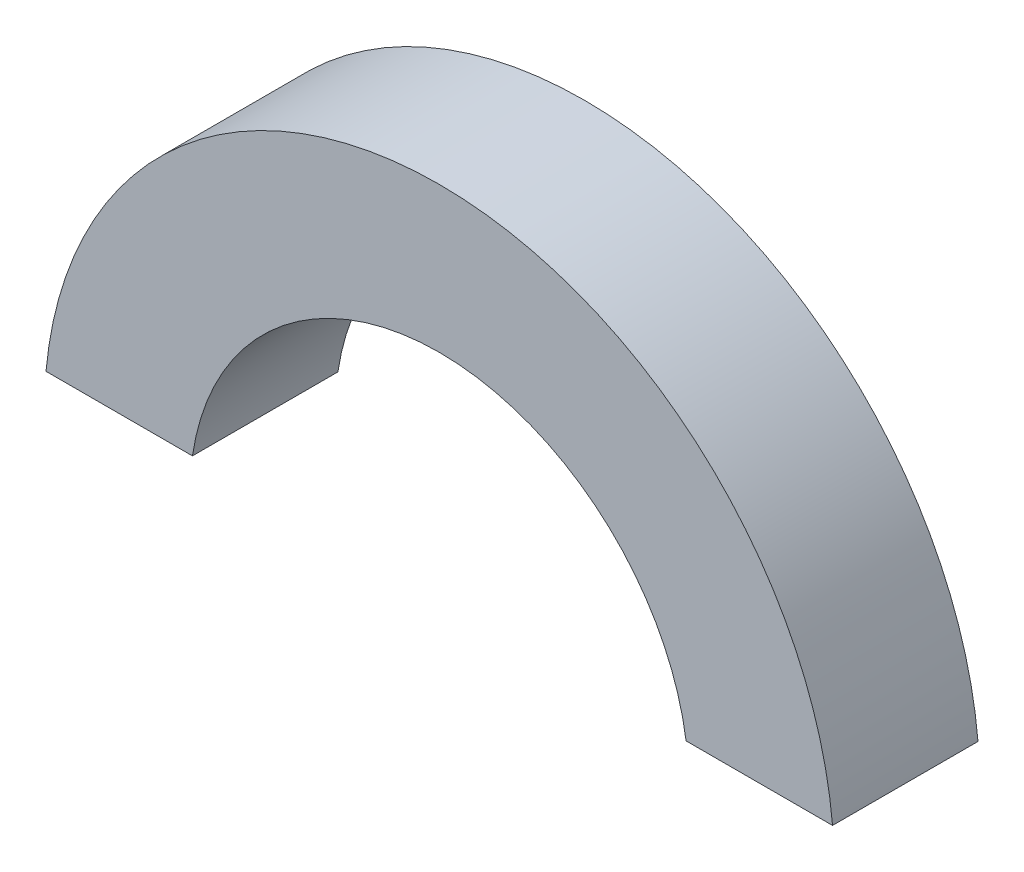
ISO-10303-21;
HEADER;
FILE_DESCRIPTION(('STEP AP214'),'2;1');
FILE_NAME('part.step','',(''),(''),'','','');
FILE_SCHEMA(('AUTOMOTIVE_DESIGN { 1 0 10303 214 1 1 1 1 }'));
ENDSEC;
DATA;
#1=APPLICATION_CONTEXT('core data for automotive mechanical design processes');
#2=APPLICATION_PROTOCOL_DEFINITION('international standard','automotive_design',2000,#1);
#3=PRODUCT_CONTEXT('',#1,'mechanical');
#4=PRODUCT('Part','Part','',(#3));
#5=PRODUCT_RELATED_PRODUCT_CATEGORY('part','',(#4));
#6=PRODUCT_DEFINITION_FORMATION('','',#4);
#7=PRODUCT_DEFINITION_CONTEXT('part definition',#1,'design');
#8=PRODUCT_DEFINITION('design','',#6,#7);
#9=PRODUCT_DEFINITION_SHAPE('','',#8);
#10=(LENGTH_UNIT() NAMED_UNIT(*) SI_UNIT(.MILLI.,.METRE.));
#11=(NAMED_UNIT(*) PLANE_ANGLE_UNIT() SI_UNIT($,.RADIAN.));
#12=(NAMED_UNIT(*) SI_UNIT($,.STERADIAN.) SOLID_ANGLE_UNIT());
#13=UNCERTAINTY_MEASURE_WITH_UNIT(LENGTH_MEASURE(1.E-05),#10,'distance_accuracy_value','');
#14=(GEOMETRIC_REPRESENTATION_CONTEXT(3) GLOBAL_UNCERTAINTY_ASSIGNED_CONTEXT((#13)) GLOBAL_UNIT_ASSIGNED_CONTEXT((#10,
#11,#12)) REPRESENTATION_CONTEXT('',''));
#15=CARTESIAN_POINT('',(0.,0.,0.));
#16=DIRECTION('',(0.,0.,1.));
#17=DIRECTION('',(1.,0.,0.));
#18=AXIS2_PLACEMENT_3D('',#15,#16,#17);
#19=CARTESIAN_POINT('',(0.,-12.7,6.35));
#20=DIRECTION('',(0.,1.,0.));
#21=DIRECTION('',(0.,0.,1.));
#22=AXIS2_PLACEMENT_3D('',#19,#20,#21);
#23=PLANE('',#22);
#24=DIRECTION('',(1.,0.,0.));
#25=VECTOR('',#24,1.);
#26=CARTESIAN_POINT('',(0.,-12.7,-6.35));
#27=LINE('',#26,#25);
#28=CARTESIAN_POINT('',(21.5478434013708,-12.7,-6.35));
#29=VERTEX_POINT('',#28);
#30=CARTESIAN_POINT('',(34.3340101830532,-12.7,-6.35));
#31=VERTEX_POINT('',#30);
#32=EDGE_CURVE('E102',#29,#31,#27,.T.);
#33=ORIENTED_EDGE('',*,*,#32,.T.);
#34=DIRECTION('',(0.,0.,-1.));
#35=VECTOR('',#34,1.);
#36=CARTESIAN_POINT('',(34.3340101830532,-12.7,6.35));
#37=LINE('',#36,#35);
#38=CARTESIAN_POINT('',(34.3340101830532,-12.7,6.35));
#39=VERTEX_POINT('',#38);
#40=EDGE_CURVE('E11',#39,#31,#37,.T.);
#41=ORIENTED_EDGE('',*,*,#40,.F.);
#42=DIRECTION('',(1.,0.,0.));
#43=VECTOR('',#42,1.);
#44=CARTESIAN_POINT('',(0.,-12.7,6.35));
#45=LINE('',#44,#43);
#46=CARTESIAN_POINT('',(21.5478434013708,-12.7,6.35));
#47=VERTEX_POINT('',#46);
#48=EDGE_CURVE('E85',#47,#39,#45,.T.);
#49=ORIENTED_EDGE('',*,*,#48,.F.);
#50=DIRECTION('',(0.,0.,-1.));
#51=VECTOR('',#50,1.);
#52=CARTESIAN_POINT('',(21.5478434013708,-12.7,6.35));
#53=LINE('',#52,#51);
#54=EDGE_CURVE('E52',#47,#29,#53,.T.);
#55=ORIENTED_EDGE('',*,*,#54,.T.);
#56=EDGE_LOOP('',(#33,#41,#49,#55));
#57=FACE_BOUND('',#56,.T.);
#58=ADVANCED_FACE('F35',(#57),#23,.F.);
#59=CARTESIAN_POINT('',(0.,-15.875,6.35));
#60=DIRECTION('',(0.,0.,-1.));
#61=DIRECTION('',(-1.,0.,0.));
#62=AXIS2_PLACEMENT_3D('',#59,#60,#61);
#63=CYLINDRICAL_SURFACE('',#62,34.4805);
#64=CARTESIAN_POINT('',(0.,-15.875,-6.35));
#65=DIRECTION('',(0.,0.,1.));
#66=DIRECTION('',(1.,0.,0.));
#67=AXIS2_PLACEMENT_3D('',#64,#65,#66);
#68=CIRCLE('',#67,34.4805);
#69=CARTESIAN_POINT('',(-34.3340101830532,-12.7,-6.35));
#70=VERTEX_POINT('',#69);
#71=EDGE_CURVE('E89',#31,#70,#68,.T.);
#72=ORIENTED_EDGE('',*,*,#71,.T.);
#73=DIRECTION('',(0.,0.,-1.));
#74=VECTOR('',#73,1.);
#75=CARTESIAN_POINT('',(-34.3340101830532,-12.7,6.35));
#76=LINE('',#75,#74);
#77=CARTESIAN_POINT('',(-34.3340101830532,-12.7,6.35));
#78=VERTEX_POINT('',#77);
#79=EDGE_CURVE('E44',#78,#70,#76,.T.);
#80=ORIENTED_EDGE('',*,*,#79,.F.);
#81=CARTESIAN_POINT('',(0.,-15.875,6.35));
#82=DIRECTION('',(0.,0.,1.));
#83=DIRECTION('',(1.,0.,0.));
#84=AXIS2_PLACEMENT_3D('',#81,#82,#83);
#85=CIRCLE('',#84,34.4805);
#86=EDGE_CURVE('E78',#39,#78,#85,.T.);
#87=ORIENTED_EDGE('',*,*,#86,.F.);
#88=ORIENTED_EDGE('',*,*,#40,.T.);
#89=EDGE_LOOP('',(#72,#80,#87,#88));
#90=FACE_BOUND('',#89,.T.);
#91=ADVANCED_FACE('F37',(#90),#63,.T.);
#92=CARTESIAN_POINT('',(-21.5478434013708,-12.7,-6.35));
#93=VERTEX_POINT('',#92);
#94=EDGE_CURVE('E98',#70,#93,#27,.T.);
#95=ORIENTED_EDGE('',*,*,#94,.T.);
#96=DIRECTION('',(0.,0.,-1.));
#97=VECTOR('',#96,1.);
#98=CARTESIAN_POINT('',(-21.5478434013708,-12.7,6.35));
#99=LINE('',#98,#97);
#100=CARTESIAN_POINT('',(-21.5478434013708,-12.7,6.35));
#101=VERTEX_POINT('',#100);
#102=EDGE_CURVE('E67',#101,#93,#99,.T.);
#103=ORIENTED_EDGE('',*,*,#102,.F.);
#104=EDGE_CURVE('E84',#78,#101,#45,.T.);
#105=ORIENTED_EDGE('',*,*,#104,.F.);
#106=ORIENTED_EDGE('',*,*,#79,.T.);
#107=EDGE_LOOP('',(#95,#103,#105,#106));
#108=FACE_BOUND('',#107,.T.);
#109=ADVANCED_FACE('F92',(#108),#23,.F.);
#110=CARTESIAN_POINT('',(0.,-15.875,6.35));
#111=DIRECTION('',(0.,0.,-1.));
#112=DIRECTION('',(-1.,0.,0.));
#113=AXIS2_PLACEMENT_3D('',#110,#111,#112);
#114=CYLINDRICAL_SURFACE('',#113,21.7805);
#115=CARTESIAN_POINT('',(0.,-15.875,-6.35));
#116=DIRECTION('',(0.,0.,1.));
#117=DIRECTION('',(1.,0.,0.));
#118=AXIS2_PLACEMENT_3D('',#115,#116,#117);
#119=CIRCLE('',#118,21.7805);
#120=EDGE_CURVE('E96',#29,#93,#119,.T.);
#121=ORIENTED_EDGE('',*,*,#120,.F.);
#122=ORIENTED_EDGE('',*,*,#54,.F.);
#123=CARTESIAN_POINT('',(0.,-15.875,6.35));
#124=DIRECTION('',(0.,0.,1.));
#125=DIRECTION('',(1.,0.,0.));
#126=AXIS2_PLACEMENT_3D('',#123,#124,#125);
#127=CIRCLE('',#126,21.7805);
#128=EDGE_CURVE('E93',#47,#101,#127,.T.);
#129=ORIENTED_EDGE('',*,*,#128,.T.);
#130=ORIENTED_EDGE('',*,*,#102,.T.);
#131=EDGE_LOOP('',(#121,#122,#129,#130));
#132=FACE_BOUND('',#131,.T.);
#133=ADVANCED_FACE('F107',(#132),#114,.F.);
#134=CARTESIAN_POINT('',(0.,0.,6.35));
#135=DIRECTION('',(0.,0.,1.));
#136=DIRECTION('',(1.,0.,0.));
#137=AXIS2_PLACEMENT_3D('',#134,#135,#136);
#138=PLANE('',#137);
#139=ORIENTED_EDGE('',*,*,#48,.T.);
#140=ORIENTED_EDGE('',*,*,#86,.T.);
#141=ORIENTED_EDGE('',*,*,#104,.T.);
#142=ORIENTED_EDGE('',*,*,#128,.F.);
#143=EDGE_LOOP('',(#139,#140,#141,#142));
#144=FACE_BOUND('',#143,.T.);
#145=ADVANCED_FACE('F81',(#144),#138,.T.);
#146=CARTESIAN_POINT('',(0.,0.,-6.35));
#147=DIRECTION('',(0.,0.,1.));
#148=DIRECTION('',(1.,0.,0.));
#149=AXIS2_PLACEMENT_3D('',#146,#147,#148);
#150=PLANE('',#149);
#151=ORIENTED_EDGE('',*,*,#32,.F.);
#152=ORIENTED_EDGE('',*,*,#120,.T.);
#153=ORIENTED_EDGE('',*,*,#94,.F.);
#154=ORIENTED_EDGE('',*,*,#71,.F.);
#155=EDGE_LOOP('',(#151,#152,#153,#154));
#156=FACE_BOUND('',#155,.T.);
#157=ADVANCED_FACE('F106',(#156),#150,.F.);
#158=CLOSED_SHELL('',(#58,#91,#109,#133,#145,#157));
#159=MANIFOLD_SOLID_BREP('B2',#158);
#160=ADVANCED_BREP_SHAPE_REPRESENTATION('',(#18,#159),#14);
#161=SHAPE_DEFINITION_REPRESENTATION(#9,#160);
ENDSEC;
END-ISO-10303-21;
